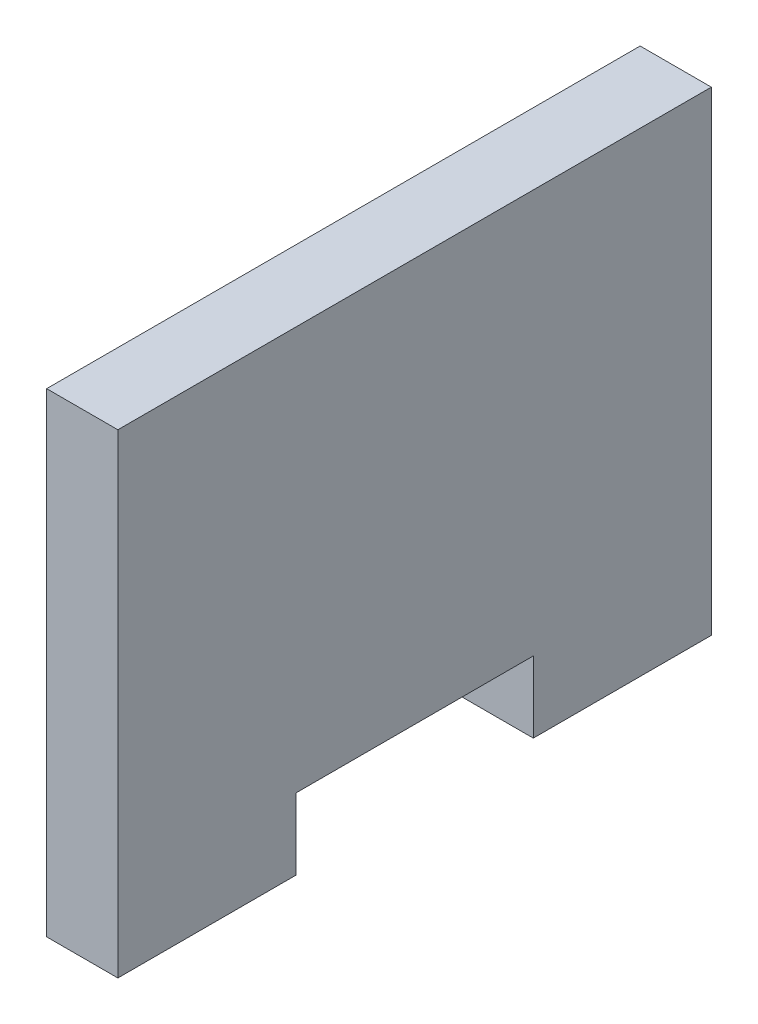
ISO-10303-21;
HEADER;
FILE_DESCRIPTION(('STEP AP214'),'2;1');
FILE_NAME('part.step','',(''),(''),'','','');
FILE_SCHEMA(('AUTOMOTIVE_DESIGN { 1 0 10303 214 1 1 1 1 }'));
ENDSEC;
DATA;
#1=APPLICATION_CONTEXT('core data for automotive mechanical design processes');
#2=APPLICATION_PROTOCOL_DEFINITION('international standard','automotive_design',2000,#1);
#3=PRODUCT_CONTEXT('',#1,'mechanical');
#4=PRODUCT('Part','Part','',(#3));
#5=PRODUCT_RELATED_PRODUCT_CATEGORY('part','',(#4));
#6=PRODUCT_DEFINITION_FORMATION('','',#4);
#7=PRODUCT_DEFINITION_CONTEXT('part definition',#1,'design');
#8=PRODUCT_DEFINITION('design','',#6,#7);
#9=PRODUCT_DEFINITION_SHAPE('','',#8);
#10=(LENGTH_UNIT() NAMED_UNIT(*) SI_UNIT(.MILLI.,.METRE.));
#11=(NAMED_UNIT(*) PLANE_ANGLE_UNIT() SI_UNIT($,.RADIAN.));
#12=(NAMED_UNIT(*) SI_UNIT($,.STERADIAN.) SOLID_ANGLE_UNIT());
#13=UNCERTAINTY_MEASURE_WITH_UNIT(LENGTH_MEASURE(1.E-05),#10,'distance_accuracy_value','');
#14=(GEOMETRIC_REPRESENTATION_CONTEXT(3) GLOBAL_UNCERTAINTY_ASSIGNED_CONTEXT((#13)) GLOBAL_UNIT_ASSIGNED_CONTEXT((#10,
#11,#12)) REPRESENTATION_CONTEXT('',''));
#15=CARTESIAN_POINT('',(0.,0.,0.));
#16=DIRECTION('',(0.,0.,1.));
#17=DIRECTION('',(1.,0.,0.));
#18=AXIS2_PLACEMENT_3D('',#15,#16,#17);
#19=CARTESIAN_POINT('',(3.,10.439101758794,31.9570604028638));
#20=DIRECTION('',(0.,0.,-1.));
#21=DIRECTION('',(0.,1.,0.));
#22=AXIS2_PLACEMENT_3D('',#19,#20,#21);
#23=PLANE('',#22);
#24=DIRECTION('',(0.,-1.,0.));
#25=VECTOR('',#24,1.);
#26=CARTESIAN_POINT('',(0.,10.439101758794,31.9570604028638));
#27=LINE('',#26,#25);
#28=CARTESIAN_POINT('',(0.,10.439101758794,31.9570604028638));
#29=VERTEX_POINT('',#28);
#30=CARTESIAN_POINT('',(0.,-9.56089824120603,31.9570604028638));
#31=VERTEX_POINT('',#30);
#32=EDGE_CURVE('E128',#29,#31,#27,.T.);
#33=ORIENTED_EDGE('',*,*,#32,.T.);
#34=DIRECTION('',(-1.,0.,0.));
#35=VECTOR('',#34,1.);
#36=CARTESIAN_POINT('',(3.,-9.56089824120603,31.9570604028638));
#37=LINE('',#36,#35);
#38=CARTESIAN_POINT('',(3.,-9.56089824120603,31.9570604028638));
#39=VERTEX_POINT('',#38);
#40=EDGE_CURVE('E11',#39,#31,#37,.T.);
#41=ORIENTED_EDGE('',*,*,#40,.F.);
#42=DIRECTION('',(0.,-1.,0.));
#43=VECTOR('',#42,1.);
#44=CARTESIAN_POINT('',(3.,10.439101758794,31.9570604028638));
#45=LINE('',#44,#43);
#46=CARTESIAN_POINT('',(3.,10.439101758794,31.9570604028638));
#47=VERTEX_POINT('',#46);
#48=EDGE_CURVE('E142',#47,#39,#45,.T.);
#49=ORIENTED_EDGE('',*,*,#48,.F.);
#50=DIRECTION('',(-1.,0.,0.));
#51=VECTOR('',#50,1.);
#52=CARTESIAN_POINT('',(3.,10.439101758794,31.9570604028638));
#53=LINE('',#52,#51);
#54=EDGE_CURVE('E124',#47,#29,#53,.T.);
#55=ORIENTED_EDGE('',*,*,#54,.T.);
#56=EDGE_LOOP('',(#33,#41,#49,#55));
#57=FACE_BOUND('',#56,.T.);
#58=ADVANCED_FACE('F32',(#57),#23,.F.);
#59=CARTESIAN_POINT('',(3.,-9.56089824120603,31.9570604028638));
#60=DIRECTION('',(0.,1.,0.));
#61=DIRECTION('',(0.,0.,1.));
#62=AXIS2_PLACEMENT_3D('',#59,#60,#61);
#63=PLANE('',#62);
#64=DIRECTION('',(0.,0.,-1.));
#65=VECTOR('',#64,1.);
#66=CARTESIAN_POINT('',(0.,-9.56089824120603,31.9570604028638));
#67=LINE('',#66,#65);
#68=CARTESIAN_POINT('',(0.,-9.56089824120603,24.4570604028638));
#69=VERTEX_POINT('',#68);
#70=EDGE_CURVE('E131',#31,#69,#67,.T.);
#71=ORIENTED_EDGE('',*,*,#70,.T.);
#72=DIRECTION('',(-1.,0.,0.));
#73=VECTOR('',#72,1.);
#74=CARTESIAN_POINT('',(3.,-9.56089824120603,24.4570604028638));
#75=LINE('',#74,#73);
#76=CARTESIAN_POINT('',(3.,-9.56089824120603,24.4570604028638));
#77=VERTEX_POINT('',#76);
#78=EDGE_CURVE('E40',#77,#69,#75,.T.);
#79=ORIENTED_EDGE('',*,*,#78,.F.);
#80=DIRECTION('',(0.,0.,-1.));
#81=VECTOR('',#80,1.);
#82=CARTESIAN_POINT('',(3.,-9.56089824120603,31.9570604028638));
#83=LINE('',#82,#81);
#84=EDGE_CURVE('E91',#39,#77,#83,.T.);
#85=ORIENTED_EDGE('',*,*,#84,.F.);
#86=ORIENTED_EDGE('',*,*,#40,.T.);
#87=EDGE_LOOP('',(#71,#79,#85,#86));
#88=FACE_BOUND('',#87,.T.);
#89=ADVANCED_FACE('F177',(#88),#63,.F.);
#90=CARTESIAN_POINT('',(3.,-9.56089824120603,24.4570604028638));
#91=DIRECTION('',(0.,0.,1.));
#92=DIRECTION('',(1.,0.,0.));
#93=AXIS2_PLACEMENT_3D('',#90,#91,#92);
#94=PLANE('',#93);
#95=DIRECTION('',(0.,1.,0.));
#96=VECTOR('',#95,1.);
#97=CARTESIAN_POINT('',(0.,-9.56089824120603,24.4570604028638));
#98=LINE('',#97,#96);
#99=CARTESIAN_POINT('',(0.,-6.56089824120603,24.4570604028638));
#100=VERTEX_POINT('',#99);
#101=EDGE_CURVE('E133',#69,#100,#98,.T.);
#102=ORIENTED_EDGE('',*,*,#101,.T.);
#103=DIRECTION('',(-1.,0.,0.));
#104=VECTOR('',#103,1.);
#105=CARTESIAN_POINT('',(3.,-6.56089824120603,24.4570604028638));
#106=LINE('',#105,#104);
#107=CARTESIAN_POINT('',(3.,-6.56089824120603,24.4570604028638));
#108=VERTEX_POINT('',#107);
#109=EDGE_CURVE('E149',#108,#100,#106,.T.);
#110=ORIENTED_EDGE('',*,*,#109,.F.);
#111=DIRECTION('',(0.,1.,0.));
#112=VECTOR('',#111,1.);
#113=CARTESIAN_POINT('',(3.,-9.56089824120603,24.4570604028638));
#114=LINE('',#113,#112);
#115=EDGE_CURVE('E157',#77,#108,#114,.T.);
#116=ORIENTED_EDGE('',*,*,#115,.F.);
#117=ORIENTED_EDGE('',*,*,#78,.T.);
#118=EDGE_LOOP('',(#102,#110,#116,#117));
#119=FACE_BOUND('',#118,.T.);
#120=ADVANCED_FACE('F155',(#119),#94,.F.);
#121=CARTESIAN_POINT('',(3.,-6.56089824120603,24.4570604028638));
#122=DIRECTION('',(0.,1.,0.));
#123=DIRECTION('',(0.,0.,1.));
#124=AXIS2_PLACEMENT_3D('',#121,#122,#123);
#125=PLANE('',#124);
#126=DIRECTION('',(0.,0.,-1.));
#127=VECTOR('',#126,1.);
#128=CARTESIAN_POINT('',(0.,-6.56089824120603,24.4570604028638));
#129=LINE('',#128,#127);
#130=CARTESIAN_POINT('',(0.,-6.56089824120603,14.4570604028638));
#131=VERTEX_POINT('',#130);
#132=EDGE_CURVE('E135',#100,#131,#129,.T.);
#133=ORIENTED_EDGE('',*,*,#132,.T.);
#134=DIRECTION('',(-1.,0.,0.));
#135=VECTOR('',#134,1.);
#136=CARTESIAN_POINT('',(3.,-6.56089824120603,14.4570604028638));
#137=LINE('',#136,#135);
#138=CARTESIAN_POINT('',(3.,-6.56089824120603,14.4570604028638));
#139=VERTEX_POINT('',#138);
#140=EDGE_CURVE('E146',#139,#131,#137,.T.);
#141=ORIENTED_EDGE('',*,*,#140,.F.);
#142=DIRECTION('',(0.,0.,-1.));
#143=VECTOR('',#142,1.);
#144=CARTESIAN_POINT('',(3.,-6.56089824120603,24.4570604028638));
#145=LINE('',#144,#143);
#146=EDGE_CURVE('E169',#108,#139,#145,.T.);
#147=ORIENTED_EDGE('',*,*,#146,.F.);
#148=ORIENTED_EDGE('',*,*,#109,.T.);
#149=EDGE_LOOP('',(#133,#141,#147,#148));
#150=FACE_BOUND('',#149,.T.);
#151=ADVANCED_FACE('F165',(#150),#125,.F.);
#152=CARTESIAN_POINT('',(3.,-9.56089824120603,14.4570604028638));
#153=DIRECTION('',(0.,0.,-1.));
#154=DIRECTION('',(-1.,0.,0.));
#155=AXIS2_PLACEMENT_3D('',#152,#153,#154);
#156=PLANE('',#155);
#157=DIRECTION('',(0.,-1.,0.));
#158=VECTOR('',#157,1.);
#159=CARTESIAN_POINT('',(0.,-9.56089824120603,14.4570604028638));
#160=LINE('',#159,#158);
#161=CARTESIAN_POINT('',(0.,-9.56089824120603,14.4570604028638));
#162=VERTEX_POINT('',#161);
#163=EDGE_CURVE('E137',#131,#162,#160,.T.);
#164=ORIENTED_EDGE('',*,*,#163,.T.);
#165=DIRECTION('',(-1.,0.,0.));
#166=VECTOR('',#165,1.);
#167=CARTESIAN_POINT('',(3.,-9.56089824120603,14.4570604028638));
#168=LINE('',#167,#166);
#169=CARTESIAN_POINT('',(3.,-9.56089824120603,14.4570604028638));
#170=VERTEX_POINT('',#169);
#171=EDGE_CURVE('E119',#170,#162,#168,.T.);
#172=ORIENTED_EDGE('',*,*,#171,.F.);
#173=DIRECTION('',(0.,-1.,0.));
#174=VECTOR('',#173,1.);
#175=CARTESIAN_POINT('',(3.,-9.56089824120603,14.4570604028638));
#176=LINE('',#175,#174);
#177=EDGE_CURVE('E110',#139,#170,#176,.T.);
#178=ORIENTED_EDGE('',*,*,#177,.F.);
#179=ORIENTED_EDGE('',*,*,#140,.T.);
#180=EDGE_LOOP('',(#164,#172,#178,#179));
#181=FACE_BOUND('',#180,.T.);
#182=ADVANCED_FACE('F168',(#181),#156,.F.);
#183=CARTESIAN_POINT('',(3.,-9.56089824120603,14.4570604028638));
#184=DIRECTION('',(0.,1.,0.));
#185=DIRECTION('',(0.,0.,1.));
#186=AXIS2_PLACEMENT_3D('',#183,#184,#185);
#187=PLANE('',#186);
#188=DIRECTION('',(0.,0.,-1.));
#189=VECTOR('',#188,1.);
#190=CARTESIAN_POINT('',(0.,-9.56089824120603,14.4570604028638));
#191=LINE('',#190,#189);
#192=CARTESIAN_POINT('',(0.,-9.56089824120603,6.95706040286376));
#193=VERTEX_POINT('',#192);
#194=EDGE_CURVE('E118',#162,#193,#191,.T.);
#195=ORIENTED_EDGE('',*,*,#194,.T.);
#196=DIRECTION('',(-1.,0.,0.));
#197=VECTOR('',#196,1.);
#198=CARTESIAN_POINT('',(3.,-9.56089824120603,6.95706040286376));
#199=LINE('',#198,#197);
#200=CARTESIAN_POINT('',(3.,-9.56089824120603,6.95706040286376));
#201=VERTEX_POINT('',#200);
#202=EDGE_CURVE('E115',#201,#193,#199,.T.);
#203=ORIENTED_EDGE('',*,*,#202,.F.);
#204=DIRECTION('',(0.,0.,-1.));
#205=VECTOR('',#204,1.);
#206=CARTESIAN_POINT('',(3.,-9.56089824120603,14.4570604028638));
#207=LINE('',#206,#205);
#208=EDGE_CURVE('E104',#170,#201,#207,.T.);
#209=ORIENTED_EDGE('',*,*,#208,.F.);
#210=ORIENTED_EDGE('',*,*,#171,.T.);
#211=EDGE_LOOP('',(#195,#203,#209,#210));
#212=FACE_BOUND('',#211,.T.);
#213=ADVANCED_FACE('F116',(#212),#187,.F.);
#214=CARTESIAN_POINT('',(3.,10.439101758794,6.95706040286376));
#215=DIRECTION('',(0.,0.,1.));
#216=DIRECTION('',(0.,-1.,0.));
#217=AXIS2_PLACEMENT_3D('',#214,#215,#216);
#218=PLANE('',#217);
#219=DIRECTION('',(0.,1.,0.));
#220=VECTOR('',#219,1.);
#221=CARTESIAN_POINT('',(0.,10.439101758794,6.95706040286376));
#222=LINE('',#221,#220);
#223=CARTESIAN_POINT('',(0.,10.439101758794,6.95706040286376));
#224=VERTEX_POINT('',#223);
#225=EDGE_CURVE('E77',#193,#224,#222,.T.);
#226=ORIENTED_EDGE('',*,*,#225,.T.);
#227=DIRECTION('',(-1.,0.,0.));
#228=VECTOR('',#227,1.);
#229=CARTESIAN_POINT('',(3.,10.439101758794,6.95706040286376));
#230=LINE('',#229,#228);
#231=CARTESIAN_POINT('',(3.,10.439101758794,6.95706040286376));
#232=VERTEX_POINT('',#231);
#233=EDGE_CURVE('E120',#232,#224,#230,.T.);
#234=ORIENTED_EDGE('',*,*,#233,.F.);
#235=DIRECTION('',(0.,1.,0.));
#236=VECTOR('',#235,1.);
#237=CARTESIAN_POINT('',(3.,10.439101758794,6.95706040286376));
#238=LINE('',#237,#236);
#239=EDGE_CURVE('E108',#201,#232,#238,.T.);
#240=ORIENTED_EDGE('',*,*,#239,.F.);
#241=ORIENTED_EDGE('',*,*,#202,.T.);
#242=EDGE_LOOP('',(#226,#234,#240,#241));
#243=FACE_BOUND('',#242,.T.);
#244=ADVANCED_FACE('F122',(#243),#218,.F.);
#245=CARTESIAN_POINT('',(3.,10.439101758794,31.9570604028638));
#246=DIRECTION('',(0.,-1.,0.));
#247=DIRECTION('',(0.,0.,-1.));
#248=AXIS2_PLACEMENT_3D('',#245,#246,#247);
#249=PLANE('',#248);
#250=DIRECTION('',(0.,0.,1.));
#251=VECTOR('',#250,1.);
#252=CARTESIAN_POINT('',(0.,10.439101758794,31.9570604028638));
#253=LINE('',#252,#251);
#254=EDGE_CURVE('E83',#224,#29,#253,.T.);
#255=ORIENTED_EDGE('',*,*,#254,.T.);
#256=ORIENTED_EDGE('',*,*,#54,.F.);
#257=DIRECTION('',(0.,0.,1.));
#258=VECTOR('',#257,1.);
#259=CARTESIAN_POINT('',(3.,10.439101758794,31.9570604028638));
#260=LINE('',#259,#258);
#261=EDGE_CURVE('E48',#232,#47,#260,.T.);
#262=ORIENTED_EDGE('',*,*,#261,.F.);
#263=ORIENTED_EDGE('',*,*,#233,.T.);
#264=EDGE_LOOP('',(#255,#256,#262,#263));
#265=FACE_BOUND('',#264,.T.);
#266=ADVANCED_FACE('F193',(#265),#249,.F.);
#267=CARTESIAN_POINT('',(3.,-9.56089824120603,31.9570604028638));
#268=DIRECTION('',(1.,0.,0.));
#269=DIRECTION('',(0.,0.,-1.));
#270=AXIS2_PLACEMENT_3D('',#267,#268,#269);
#271=PLANE('',#270);
#272=ORIENTED_EDGE('',*,*,#48,.T.);
#273=ORIENTED_EDGE('',*,*,#84,.T.);
#274=ORIENTED_EDGE('',*,*,#115,.T.);
#275=ORIENTED_EDGE('',*,*,#146,.T.);
#276=ORIENTED_EDGE('',*,*,#177,.T.);
#277=ORIENTED_EDGE('',*,*,#208,.T.);
#278=ORIENTED_EDGE('',*,*,#239,.T.);
#279=ORIENTED_EDGE('',*,*,#261,.T.);
#280=EDGE_LOOP('',(#272,#273,#274,#275,#276,#277,#278,#279));
#281=FACE_BOUND('',#280,.T.);
#282=ADVANCED_FACE('F106',(#281),#271,.T.);
#283=CARTESIAN_POINT('',(0.,-9.56089824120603,31.9570604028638));
#284=DIRECTION('',(1.,0.,0.));
#285=DIRECTION('',(0.,0.,-1.));
#286=AXIS2_PLACEMENT_3D('',#283,#284,#285);
#287=PLANE('',#286);
#288=ORIENTED_EDGE('',*,*,#32,.F.);
#289=ORIENTED_EDGE('',*,*,#254,.F.);
#290=ORIENTED_EDGE('',*,*,#225,.F.);
#291=ORIENTED_EDGE('',*,*,#194,.F.);
#292=ORIENTED_EDGE('',*,*,#163,.F.);
#293=ORIENTED_EDGE('',*,*,#132,.F.);
#294=ORIENTED_EDGE('',*,*,#101,.F.);
#295=ORIENTED_EDGE('',*,*,#70,.F.);
#296=EDGE_LOOP('',(#288,#289,#290,#291,#292,#293,#294,#295));
#297=FACE_BOUND('',#296,.T.);
#298=ADVANCED_FACE('F161',(#297),#287,.F.);
#299=CLOSED_SHELL('',(#58,#89,#120,#151,#182,#213,#244,#266,#282,#298));
#300=MANIFOLD_SOLID_BREP('B2',#299);
#301=ADVANCED_BREP_SHAPE_REPRESENTATION('',(#18,#300),#14);
#302=SHAPE_DEFINITION_REPRESENTATION(#9,#301);
ENDSEC;
END-ISO-10303-21;
